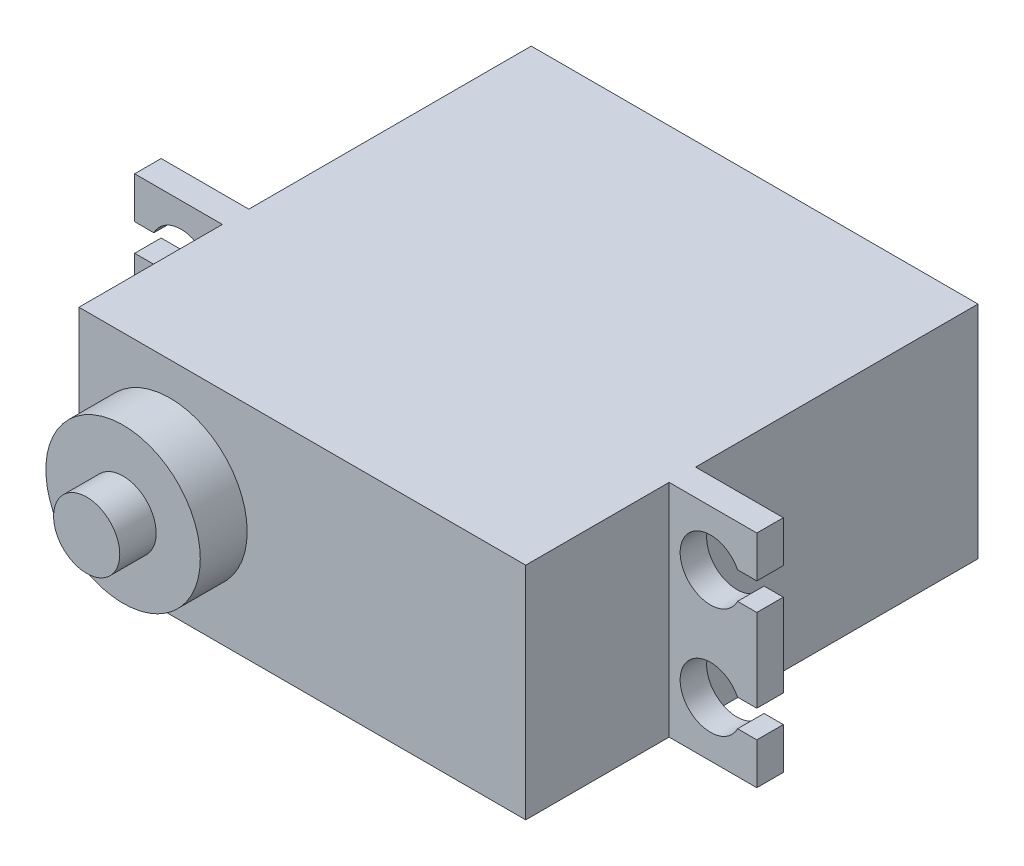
from build123d import *

# Parameters (mm, degrees)
SKETCH_1_W          = 40.5
SKETCH_1_H          = 20
EXTRUDE_1_DEPTH     = 41
SKETCH_2_W          = 7.95
SKETCH_2_H          = 2.4
EXTRUDE_2_DEPTH     = 20
CUT_EXTRUDE_1_DEPTH = 41.978530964
SKETCH_4_R          = 7
EXTRUDE_3_DEPTH     = 4.25
SKETCH_5_R          = 3
EXTRUDE_4_DEPTH     = 3.3


with BuildPart() as part:
    # Sketch 1 → Extrude 1 (new body)
    with BuildSketch(Plane.XY):
        Rectangle(SKETCH_1_W, SKETCH_1_H)
    extrude(amount=EXTRUDE_1_DEPTH)

    # Sketch 2 → Extrude 2 (add)
    with BuildSketch(Plane.XZ.offset(10)):
        with Locations((24.225, 26.8)):
            Rectangle(SKETCH_2_W, SKETCH_2_H)
        with Locations((-24.225, 26.8)):
            Rectangle(SKETCH_2_W, SKETCH_2_H)
    extrude(amount=-EXTRUDE_2_DEPTH)

    # Sketch 3 → Cut-Extrude 1 (cut, through all)
    with BuildSketch(Plane.XY.offset(28)):
        with BuildLine():
            Line((-26.455182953, 6.238780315), (-28.2, 6.238780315))
            Line((-28.2, 6.238780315), (-28.2, 3.761219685))
            Line((-28.2, 3.761219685), (-26.455182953, 3.761219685))
            ThreePointArc((-26.455182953, 3.761219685), (-21.25, 5), (-26.455182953, 6.238780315))
        make_face()
        with BuildLine():
            Line((26.455182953, 3.761219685), (28.2, 3.761219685))
            Line((28.2, 3.761219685), (28.2, 6.238780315))
            Line((28.2, 6.238780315), (26.455182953, 6.238780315))
            ThreePointArc((26.455182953, 6.238780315), (21.25, 5), (26.455182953, 3.761219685))
        make_face()
        with BuildLine():
            Line((26.455182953, -6.238780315), (28.2, -6.238780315))
            Line((28.2, -6.238780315), (28.2, -3.761219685))
            Line((28.2, -3.761219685), (26.455182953, -3.761219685))
            ThreePointArc((26.455182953, -3.761219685), (21.25, -5), (26.455182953, -6.238780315))
        make_face()
        with BuildLine():
            Line((-26.455182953, -6.238780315), (-28.2, -6.238780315))
            Line((-28.2, -6.238780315), (-28.2, -3.761219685))
            Line((-28.2, -3.761219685), (-26.455182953, -3.761219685))
            ThreePointArc((-26.455182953, -3.761219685), (-21.25, -5), (-26.455182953, -6.238780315))
        make_face()
    extrude(amount=-CUT_EXTRUDE_1_DEPTH, mode=Mode.SUBTRACT)

    # Sketch 4 → Extrude 3 (add)
    with BuildSketch(Plane.XY.offset(41)):
        with Locations((-12, 0)):
            Circle(SKETCH_4_R)
    extrude(amount=EXTRUDE_3_DEPTH)

    # Sketch 5 → Extrude 4 (add)
    with BuildSketch(Plane.XY.offset(45.25)):
        with Locations((-12, 0)):
            Circle(SKETCH_5_R)
    extrude(amount=EXTRUDE_4_DEPTH)


solid = part.part
